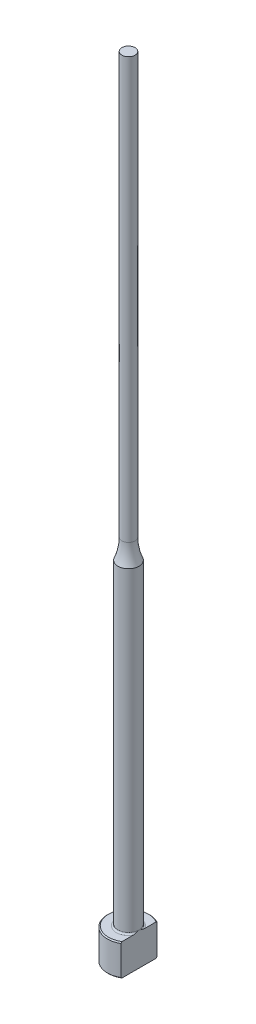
from build123d import *
from build123d.topology import SkipClean

# Parameters (mm, degrees)
CHAMFER1_SIZE    = 0.2
FILLET1_R        = 0.3
KEYED_HEAD_DEPTH = 151.106628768


with BuildPart() as part:
    # Sketch1 → Revolve1 (revolve)
    with BuildSketch(Plane.XY, mode=Mode.PRIVATE) as revolve1_sk:
        with BuildLine():
            Line((0, 0), (-4, 0))
            Line((-4, 0), (-4, 6))
            Line((-4, 6), (-2, 6))
            Line((-2, 6), (-2, 66.200328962))
            ThreePointArc((-2, 66.200328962), (-1.439291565, 68.063508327), (-1.25, 70))
            Line((-1.25, 70), (-1.25, 150))
            Line((-1.25, 150), (0, 150))
            Line((0, 150), (0, 0))
        make_face()
    revolve(revolve1_sk.sketch.rotate(Axis((0, 259.958771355, 0), (0, -1, 0)), 270), axis=Axis((0, 259.958771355, 0), (0, -1, 0)))

    # Chamfer1
    chamfer1_edges = [part.edges().sort_by_distance(p)[0] for p in [
        (0, 0, -4),
        (0, 6, -4),
    ]]
    chamfer(chamfer1_edges, length=CHAMFER1_SIZE)

    # Fillet1
    fillet1_edges = [part.edges().sort_by_distance(p)[0] for p in [
        (0, 6, -2),
    ]]
    fillet(fillet1_edges, radius=FILLET1_R)

    # Sketch2 → Keyed Head (cut, through all)
    with SkipClean():  # the faces are left unmerged after this step: merging them gives an invalid solid
        with BuildSketch(Plane(origin=(0, 0, 0), x_dir=(1, 0, 0), z_dir=(0, 1, 0))):
            with BuildLine():
                Line((2, -3.464101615), (2, 3.464101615))
                ThreePointArc((2, 3.464101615), (4, 0), (2, -3.464101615))
            make_face()
        extrude(amount=KEYED_HEAD_DEPTH, mode=Mode.SUBTRACT)


solid = part.part
